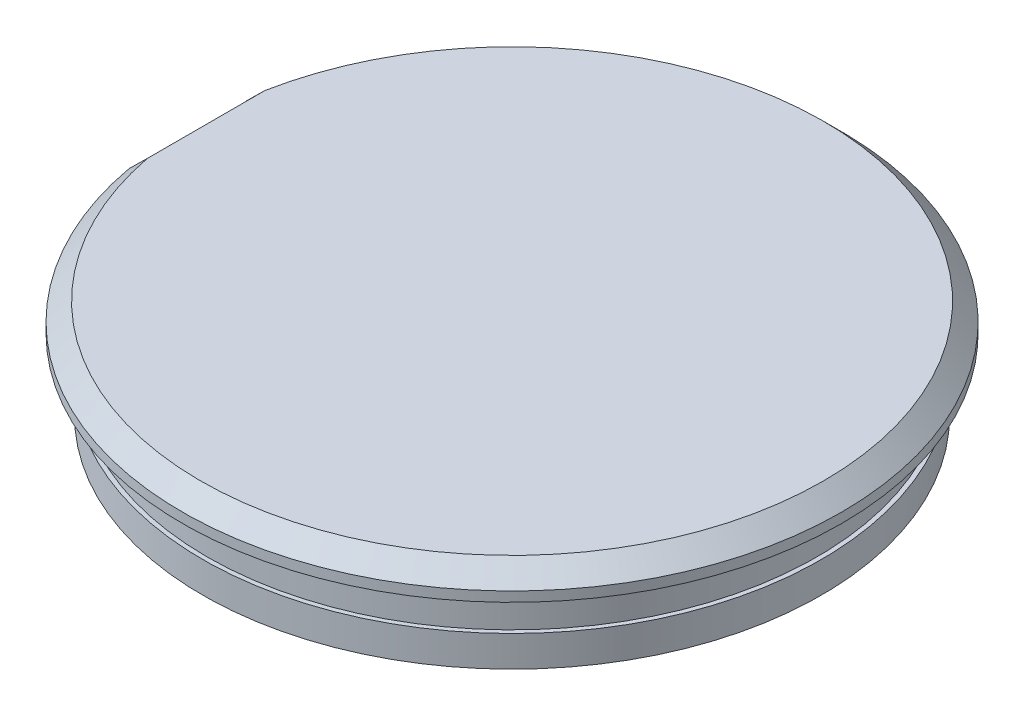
ISO-10303-21;
HEADER;
FILE_DESCRIPTION(('STEP AP214'),'2;1');
FILE_NAME('part.step','',(''),(''),'','','');
FILE_SCHEMA(('AUTOMOTIVE_DESIGN { 1 0 10303 214 1 1 1 1 }'));
ENDSEC;
DATA;
#1=APPLICATION_CONTEXT('core data for automotive mechanical design processes');
#2=APPLICATION_PROTOCOL_DEFINITION('international standard','automotive_design',2000,#1);
#3=PRODUCT_CONTEXT('',#1,'mechanical');
#4=PRODUCT('Part','Part','',(#3));
#5=PRODUCT_RELATED_PRODUCT_CATEGORY('part','',(#4));
#6=PRODUCT_DEFINITION_FORMATION('','',#4);
#7=PRODUCT_DEFINITION_CONTEXT('part definition',#1,'design');
#8=PRODUCT_DEFINITION('design','',#6,#7);
#9=PRODUCT_DEFINITION_SHAPE('','',#8);
#10=(LENGTH_UNIT() NAMED_UNIT(*) SI_UNIT(.MILLI.,.METRE.));
#11=(NAMED_UNIT(*) PLANE_ANGLE_UNIT() SI_UNIT($,.RADIAN.));
#12=(NAMED_UNIT(*) SI_UNIT($,.STERADIAN.) SOLID_ANGLE_UNIT());
#13=UNCERTAINTY_MEASURE_WITH_UNIT(LENGTH_MEASURE(1.E-05),#10,'distance_accuracy_value','');
#14=(GEOMETRIC_REPRESENTATION_CONTEXT(3) GLOBAL_UNCERTAINTY_ASSIGNED_CONTEXT((#13)) GLOBAL_UNIT_ASSIGNED_CONTEXT((#10,
#11,#12)) REPRESENTATION_CONTEXT('',''));
#15=CARTESIAN_POINT('',(0.,0.,0.));
#16=DIRECTION('',(0.,0.,1.));
#17=DIRECTION('',(1.,0.,0.));
#18=AXIS2_PLACEMENT_3D('',#15,#16,#17);
#19=CARTESIAN_POINT('',(0.,0.0919793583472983,0.));
#20=DIRECTION('',(0.,-1.,0.));
#21=DIRECTION('',(0.,0.,-1.));
#22=AXIS2_PLACEMENT_3D('',#19,#20,#21);
#23=PLANE('',#22);
#24=DIRECTION('',(0.,0.,1.));
#25=VECTOR('',#24,1.);
#26=CARTESIAN_POINT('',(-10.3835109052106,0.0919793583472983,0.));
#27=LINE('',#26,#25);
#28=CARTESIAN_POINT('',(-10.3835109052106,0.0919793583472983,-1.55971192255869));
#29=VERTEX_POINT('',#28);
#30=CARTESIAN_POINT('',(-10.3835109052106,0.0919793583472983,1.55971192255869));
#31=VERTEX_POINT('',#30);
#32=EDGE_CURVE('E175',#29,#31,#27,.T.);
#33=ORIENTED_EDGE('',*,*,#32,.F.);
#34=CARTESIAN_POINT('',(0.,0.0919793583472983,0.));
#35=DIRECTION('',(0.,-1.,0.));
#36=DIRECTION('',(0.,0.,-1.));
#37=AXIS2_PLACEMENT_3D('',#34,#35,#36);
#38=CIRCLE('',#37,10.5);
#39=EDGE_CURVE('E11',#29,#31,#38,.T.);
#40=ORIENTED_EDGE('',*,*,#39,.T.);
#41=EDGE_LOOP('',(#33,#40));
#42=FACE_BOUND('',#41,.T.);
#43=ADVANCED_FACE('F33',(#42),#23,.T.);
#44=CARTESIAN_POINT('',(0.,0.,0.));
#45=DIRECTION('',(0.,-1.,0.));
#46=DIRECTION('',(0.,0.,-1.));
#47=AXIS2_PLACEMENT_3D('',#44,#45,#46);
#48=CYLINDRICAL_SURFACE('',#47,10.5);
#49=DIRECTION('',(0.,-1.,0.));
#50=VECTOR('',#49,1.);
#51=CARTESIAN_POINT('',(-10.3835109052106,0.,1.55971192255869));
#52=LINE('',#51,#50);
#53=CARTESIAN_POINT('',(-10.3835109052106,1.1419793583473,1.55971192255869));
#54=VERTEX_POINT('',#53);
#55=EDGE_CURVE('E55',#31,#54,#52,.F.);
#56=ORIENTED_EDGE('',*,*,#55,.F.);
#57=ORIENTED_EDGE('',*,*,#39,.F.);
#58=DIRECTION('',(0.,-1.,0.));
#59=VECTOR('',#58,1.);
#60=CARTESIAN_POINT('',(-10.3835109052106,0.,-1.55971192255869));
#61=LINE('',#60,#59);
#62=CARTESIAN_POINT('',(-10.3835109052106,1.1419793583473,-1.55971192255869));
#63=VERTEX_POINT('',#62);
#64=EDGE_CURVE('E201',#63,#29,#61,.T.);
#65=ORIENTED_EDGE('',*,*,#64,.F.);
#66=CARTESIAN_POINT('',(0.,1.1419793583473,0.));
#67=DIRECTION('',(0.,-1.,0.));
#68=DIRECTION('',(0.,0.,-1.));
#69=AXIS2_PLACEMENT_3D('',#66,#67,#68);
#70=CIRCLE('',#69,10.5);
#71=EDGE_CURVE('E40',#63,#54,#70,.T.);
#72=ORIENTED_EDGE('',*,*,#71,.T.);
#73=EDGE_LOOP('',(#56,#57,#65,#72));
#74=FACE_BOUND('',#73,.T.);
#75=ADVANCED_FACE('F199',(#74),#48,.T.);
#76=CARTESIAN_POINT('',(10.5,1.1419793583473,0.));
#77=DIRECTION('',(0.,1.,0.));
#78=DIRECTION('',(0.,0.,1.));
#79=AXIS2_PLACEMENT_3D('',#76,#77,#78);
#80=PLANE('',#79);
#81=DIRECTION('',(0.,0.,-1.));
#82=VECTOR('',#81,1.);
#83=CARTESIAN_POINT('',(-10.3835109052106,1.1419793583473,0.));
#84=LINE('',#83,#82);
#85=EDGE_CURVE('E205',#54,#63,#84,.T.);
#86=ORIENTED_EDGE('',*,*,#85,.F.);
#87=ORIENTED_EDGE('',*,*,#71,.F.);
#88=EDGE_LOOP('',(#86,#87));
#89=FACE_BOUND('',#88,.T.);
#90=CARTESIAN_POINT('',(0.,1.1419793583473,0.));
#91=DIRECTION('',(0.,-1.,0.));
#92=DIRECTION('',(0.,0.,-1.));
#93=AXIS2_PLACEMENT_3D('',#90,#91,#92);
#94=CIRCLE('',#93,10.35);
#95=CARTESIAN_POINT('',(0.,1.1419793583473,-10.35));
#96=VERTEX_POINT('',#95);
#97=EDGE_CURVE('E193',#96,#96,#94,.T.);
#98=ORIENTED_EDGE('',*,*,#97,.T.);
#99=EDGE_LOOP('',(#98));
#100=FACE_BOUND('',#99,.T.);
#101=ADVANCED_FACE('F203',(#89,#100),#80,.T.);
#102=CARTESIAN_POINT('',(0.,0.,0.));
#103=DIRECTION('',(0.,-1.,0.));
#104=DIRECTION('',(0.,0.,-1.));
#105=AXIS2_PLACEMENT_3D('',#102,#103,#104);
#106=CYLINDRICAL_SURFACE('',#105,10.35);
#107=CARTESIAN_POINT('',(0.,2.5419793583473,0.));
#108=DIRECTION('',(0.,-1.,0.));
#109=DIRECTION('',(0.,0.,-1.));
#110=AXIS2_PLACEMENT_3D('',#107,#108,#109);
#111=CIRCLE('',#110,10.35);
#112=CARTESIAN_POINT('',(-10.1561455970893,2.5419793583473,1.99379201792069));
#113=VERTEX_POINT('',#112);
#114=CARTESIAN_POINT('',(-10.1561455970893,2.5419793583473,-1.99379201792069));
#115=VERTEX_POINT('',#114);
#116=EDGE_CURVE('E190',#113,#115,#111,.T.);
#117=ORIENTED_EDGE('',*,*,#116,.T.);
#118=EDGE_CURVE('E189',#115,#113,#111,.T.);
#119=ORIENTED_EDGE('',*,*,#118,.T.);
#120=EDGE_LOOP('',(#117,#119));
#121=FACE_BOUND('',#120,.T.);
#122=ORIENTED_EDGE('',*,*,#97,.F.);
#123=EDGE_LOOP('',(#122));
#124=FACE_BOUND('',#123,.T.);
#125=ADVANCED_FACE('F218',(#121,#124),#106,.T.);
#126=CARTESIAN_POINT('',(10.35,2.5419793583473,0.));
#127=DIRECTION('',(0.,-1.,0.));
#128=DIRECTION('',(0.,0.,-1.));
#129=AXIS2_PLACEMENT_3D('',#126,#127,#128);
#130=PLANE('',#129);
#131=DIRECTION('',(-1.,0.,0.));
#132=VECTOR('',#131,1.);
#133=CARTESIAN_POINT('',(10.35,2.5419793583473,1.99379201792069));
#134=LINE('',#133,#132);
#135=CARTESIAN_POINT('',(-11.0068365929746,2.5419793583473,1.99379201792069));
#136=VERTEX_POINT('',#135);
#137=EDGE_CURVE('E206',#113,#136,#134,.T.);
#138=ORIENTED_EDGE('',*,*,#137,.F.);
#139=ORIENTED_EDGE('',*,*,#118,.F.);
#140=DIRECTION('',(1.,0.,0.));
#141=VECTOR('',#140,1.);
#142=CARTESIAN_POINT('',(10.35,2.5419793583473,-1.99379201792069));
#143=LINE('',#142,#141);
#144=CARTESIAN_POINT('',(-11.0068365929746,2.5419793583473,-1.99379201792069));
#145=VERTEX_POINT('',#144);
#146=EDGE_CURVE('E178',#145,#115,#143,.T.);
#147=ORIENTED_EDGE('',*,*,#146,.F.);
#148=CARTESIAN_POINT('',(0.,2.5419793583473,0.));
#149=DIRECTION('',(0.,-1.,0.));
#150=DIRECTION('',(0.,0.,-1.));
#151=AXIS2_PLACEMENT_3D('',#148,#149,#150);
#152=CIRCLE('',#151,11.1859580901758);
#153=EDGE_CURVE('E186',#145,#136,#152,.T.);
#154=ORIENTED_EDGE('',*,*,#153,.T.);
#155=EDGE_LOOP('',(#138,#139,#147,#154));
#156=FACE_BOUND('',#155,.T.);
#157=ADVANCED_FACE('F223',(#156),#130,.T.);
#158=CARTESIAN_POINT('',(0.,0.,0.));
#159=DIRECTION('',(0.,-1.,0.));
#160=DIRECTION('',(0.,0.,-1.));
#161=AXIS2_PLACEMENT_3D('',#158,#159,#160);
#162=CYLINDRICAL_SURFACE('',#161,11.1859580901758);
#163=DIRECTION('',(0.,-1.,0.));
#164=VECTOR('',#163,1.);
#165=CARTESIAN_POINT('',(-11.0068365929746,0.,-1.99379201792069));
#166=LINE('',#165,#164);
#167=CARTESIAN_POINT('',(-11.0068365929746,2.87643509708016,-1.99379201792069));
#168=VERTEX_POINT('',#167);
#169=EDGE_CURVE('E174',#168,#145,#166,.T.);
#170=ORIENTED_EDGE('',*,*,#169,.F.);
#171=CARTESIAN_POINT('',(0.,2.87643509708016,0.));
#172=DIRECTION('',(0.,-1.,0.));
#173=DIRECTION('',(0.,0.,-1.));
#174=AXIS2_PLACEMENT_3D('',#171,#172,#173);
#175=CIRCLE('',#174,11.1859580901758);
#176=CARTESIAN_POINT('',(-11.0068365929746,2.87643509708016,1.99379201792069));
#177=VERTEX_POINT('',#176);
#178=EDGE_CURVE('E183',#168,#177,#175,.T.);
#179=ORIENTED_EDGE('',*,*,#178,.T.);
#180=DIRECTION('',(0.,-1.,0.));
#181=VECTOR('',#180,1.);
#182=CARTESIAN_POINT('',(-11.0068365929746,0.,1.99379201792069));
#183=LINE('',#182,#181);
#184=EDGE_CURVE('E149',#136,#177,#183,.F.);
#185=ORIENTED_EDGE('',*,*,#184,.F.);
#186=ORIENTED_EDGE('',*,*,#153,.F.);
#187=EDGE_LOOP('',(#170,#179,#185,#186));
#188=FACE_BOUND('',#187,.T.);
#189=ADVANCED_FACE('F226',(#188),#162,.T.);
#190=CARTESIAN_POINT('',(0.,2.87643509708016,0.));
#191=DIRECTION('',(0.,-1.,0.));
#192=DIRECTION('',(0.,0.,-1.));
#193=AXIS2_PLACEMENT_3D('',#190,#191,#192);
#194=CONICAL_SURFACE('',#193,11.1859580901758,0.785398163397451);
#195=CARTESIAN_POINT('',(-9.60490562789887,4.25273372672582,-1.99379201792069));
#196=CARTESIAN_POINT('',(-9.83275399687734,4.02963637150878,-1.99379201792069));
#197=CARTESIAN_POINT('',(-10.0604432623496,3.80637666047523,-1.99379201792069));
#198=CARTESIAN_POINT('',(-10.5155521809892,3.35958305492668,-1.99379201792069));
#199=CARTESIAN_POINT('',(-10.7429718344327,3.13604916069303,-1.99379201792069));
#200=CARTESIAN_POINT('',(-11.1975905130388,2.68875733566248,-1.99379201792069));
#201=CARTESIAN_POINT('',(-11.4247895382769,2.46499940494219,-1.99379201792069));
#202=CARTESIAN_POINT('',(-11.879001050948,2.01729382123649,-1.99379201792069));
#203=CARTESIAN_POINT('',(-12.1060135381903,1.79334616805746,-1.99379201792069));
#204=CARTESIAN_POINT('',(-12.3329495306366,1.56932107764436,-1.99379201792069));
#205=B_SPLINE_CURVE_WITH_KNOTS('',3,(#195,#196,#197,#198,#199,#200,#201,#202,#203,#204),
.UNSPECIFIED.,.F.,.F.,(4,2,2,2,4),(0.,0.956653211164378,1.91330544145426,2.86995734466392,
3.82661022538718),.UNSPECIFIED.);
#206=CARTESIAN_POINT('',(-10.3835109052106,3.48919568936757,-1.99379201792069));
#207=VERTEX_POINT('',#206);
#208=EDGE_CURVE('E168',#207,#168,#205,.T.);
#209=ORIENTED_EDGE('',*,*,#208,.F.);
#210=CARTESIAN_POINT('',(0.,3.48919568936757,0.));
#211=DIRECTION('',(0.,-1.,0.));
#212=DIRECTION('',(0.,0.,-1.));
#213=AXIS2_PLACEMENT_3D('',#210,#211,#212);
#214=CIRCLE('',#213,10.5731974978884);
#215=CARTESIAN_POINT('',(-10.3835109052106,3.48919568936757,1.99379201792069));
#216=VERTEX_POINT('',#215);
#217=EDGE_CURVE('E180',#207,#216,#214,.T.);
#218=ORIENTED_EDGE('',*,*,#217,.T.);
#219=CARTESIAN_POINT('',(-12.3329495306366,1.56932107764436,1.99379201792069));
#220=CARTESIAN_POINT('',(-12.1060135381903,1.79334616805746,1.99379201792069));
#221=CARTESIAN_POINT('',(-11.879001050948,2.0172938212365,1.99379201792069));
#222=CARTESIAN_POINT('',(-11.4247895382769,2.46499940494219,1.99379201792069));
#223=CARTESIAN_POINT('',(-11.1975905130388,2.68875733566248,1.99379201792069));
#224=CARTESIAN_POINT('',(-10.7429718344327,3.13604916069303,1.99379201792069));
#225=CARTESIAN_POINT('',(-10.5155521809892,3.35958305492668,1.99379201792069));
#226=CARTESIAN_POINT('',(-10.0604432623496,3.80637666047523,1.99379201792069));
#227=CARTESIAN_POINT('',(-9.83275399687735,4.02963637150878,1.99379201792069));
#228=CARTESIAN_POINT('',(-9.60490562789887,4.25273372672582,1.99379201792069));
#229=B_SPLINE_CURVE_WITH_KNOTS('',3,(#219,#220,#221,#222,#223,#224,#225,#226,#227,#228),
.UNSPECIFIED.,.F.,.F.,(4,2,2,2,4),(0.,0.956652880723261,1.91330478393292,2.8699570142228,
3.82661022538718),.UNSPECIFIED.);
#230=EDGE_CURVE('E141',#177,#216,#229,.T.);
#231=ORIENTED_EDGE('',*,*,#230,.F.);
#232=ORIENTED_EDGE('',*,*,#178,.F.);
#233=EDGE_LOOP('',(#209,#218,#231,#232));
#234=FACE_BOUND('',#233,.T.);
#235=ADVANCED_FACE('F151',(#234),#194,.T.);
#236=CARTESIAN_POINT('',(10.5731974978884,3.48919568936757,0.));
#237=DIRECTION('',(0.,1.,0.));
#238=DIRECTION('',(0.,0.,1.));
#239=AXIS2_PLACEMENT_3D('',#236,#237,#238);
#240=PLANE('',#239);
#241=DIRECTION('',(0.,0.,-1.));
#242=VECTOR('',#241,1.);
#243=CARTESIAN_POINT('',(-10.3835109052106,3.48919568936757,-1.99379201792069));
#244=LINE('',#243,#242);
#245=EDGE_CURVE('E132',#216,#207,#244,.T.);
#246=ORIENTED_EDGE('',*,*,#245,.F.);
#247=ORIENTED_EDGE('',*,*,#217,.F.);
#248=EDGE_LOOP('',(#246,#247));
#249=FACE_BOUND('',#248,.T.);
#250=ADVANCED_FACE('F166',(#249),#240,.T.);
#251=CARTESIAN_POINT('',(-10.3835109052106,-6.51080431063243,-1.99379201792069));
#252=DIRECTION('',(1.,0.,0.));
#253=DIRECTION('',(0.,0.,-1.));
#254=AXIS2_PLACEMENT_3D('',#251,#252,#253);
#255=PLANE('',#254);
#256=DIRECTION('',(0.,1.,0.));
#257=VECTOR('',#256,1.);
#258=CARTESIAN_POINT('',(-10.3835109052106,-6.51080431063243,-1.99379201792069));
#259=LINE('',#258,#257);
#260=CARTESIAN_POINT('',(-10.3835109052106,3.04356179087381,-1.99379201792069));
#261=VERTEX_POINT('',#260);
#262=EDGE_CURVE('E139',#261,#207,#259,.T.);
#263=ORIENTED_EDGE('',*,*,#262,.F.);
#264=DIRECTION('',(0.,0.,-1.));
#265=VECTOR('',#264,1.);
#266=CARTESIAN_POINT('',(-10.3835109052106,3.04356179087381,1.99379201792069));
#267=LINE('',#266,#265);
#268=CARTESIAN_POINT('',(-10.3835109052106,3.04356179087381,1.99379201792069));
#269=VERTEX_POINT('',#268);
#270=EDGE_CURVE('E47',#269,#261,#267,.T.);
#271=ORIENTED_EDGE('',*,*,#270,.F.);
#272=DIRECTION('',(0.,1.,0.));
#273=VECTOR('',#272,1.);
#274=CARTESIAN_POINT('',(-10.3835109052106,-6.51080431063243,1.99379201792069));
#275=LINE('',#274,#273);
#276=EDGE_CURVE('E111',#269,#216,#275,.T.);
#277=ORIENTED_EDGE('',*,*,#276,.T.);
#278=ORIENTED_EDGE('',*,*,#245,.T.);
#279=EDGE_LOOP('',(#263,#271,#277,#278));
#280=FACE_BOUND('',#279,.T.);
#281=ADVANCED_FACE('F160',(#280),#255,.F.);
#282=CARTESIAN_POINT('',(-11.9884052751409,-6.51080431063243,1.99379201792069));
#283=DIRECTION('',(0.,0.,1.));
#284=DIRECTION('',(1.,0.,0.));
#285=AXIS2_PLACEMENT_3D('',#282,#283,#284);
#286=PLANE('',#285);
#287=ORIENTED_EDGE('',*,*,#137,.T.);
#288=ORIENTED_EDGE('',*,*,#184,.T.);
#289=ORIENTED_EDGE('',*,*,#230,.T.);
#290=ORIENTED_EDGE('',*,*,#276,.F.);
#291=DIRECTION('',(-1.,0.,0.));
#292=VECTOR('',#291,1.);
#293=CARTESIAN_POINT('',(-9.38351090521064,3.04356179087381,1.99379201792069));
#294=LINE('',#293,#292);
#295=CARTESIAN_POINT('',(-9.38351090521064,3.04356179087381,1.99379201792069));
#296=VERTEX_POINT('',#295);
#297=EDGE_CURVE('E103',#296,#269,#294,.T.);
#298=ORIENTED_EDGE('',*,*,#297,.F.);
#299=DIRECTION('',(0.,1.,0.));
#300=VECTOR('',#299,1.);
#301=CARTESIAN_POINT('',(-9.38351090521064,2.5419793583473,1.99379201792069));
#302=LINE('',#301,#300);
#303=CARTESIAN_POINT('',(-9.38351090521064,2.5419793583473,1.99379201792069));
#304=VERTEX_POINT('',#303);
#305=EDGE_CURVE('E108',#304,#296,#302,.T.);
#306=ORIENTED_EDGE('',*,*,#305,.F.);
#307=DIRECTION('',(-1.,0.,0.));
#308=VECTOR('',#307,1.);
#309=CARTESIAN_POINT('',(-9.38351090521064,2.5419793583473,1.99379201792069));
#310=LINE('',#309,#308);
#311=EDGE_CURVE('E130',#304,#113,#310,.T.);
#312=ORIENTED_EDGE('',*,*,#311,.T.);
#313=EDGE_LOOP('',(#287,#288,#289,#290,#298,#306,#312));
#314=FACE_BOUND('',#313,.T.);
#315=ADVANCED_FACE('F105',(#314),#286,.F.);
#316=CARTESIAN_POINT('',(-11.9884052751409,-6.51080431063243,-1.99379201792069));
#317=DIRECTION('',(0.,0.,-1.));
#318=DIRECTION('',(-1.,0.,0.));
#319=AXIS2_PLACEMENT_3D('',#316,#317,#318);
#320=PLANE('',#319);
#321=ORIENTED_EDGE('',*,*,#146,.T.);
#322=DIRECTION('',(-1.,0.,0.));
#323=VECTOR('',#322,1.);
#324=CARTESIAN_POINT('',(-9.38351090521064,2.5419793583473,-1.99379201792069));
#325=LINE('',#324,#323);
#326=CARTESIAN_POINT('',(-9.38351090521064,2.5419793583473,-1.99379201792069));
#327=VERTEX_POINT('',#326);
#328=EDGE_CURVE('E133',#327,#115,#325,.T.);
#329=ORIENTED_EDGE('',*,*,#328,.F.);
#330=DIRECTION('',(0.,-1.,0.));
#331=VECTOR('',#330,1.);
#332=CARTESIAN_POINT('',(-9.38351090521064,2.5419793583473,-1.99379201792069));
#333=LINE('',#332,#331);
#334=CARTESIAN_POINT('',(-9.38351090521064,3.04356179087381,-1.99379201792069));
#335=VERTEX_POINT('',#334);
#336=EDGE_CURVE('E121',#335,#327,#333,.T.);
#337=ORIENTED_EDGE('',*,*,#336,.F.);
#338=DIRECTION('',(-1.,0.,0.));
#339=VECTOR('',#338,1.);
#340=CARTESIAN_POINT('',(-9.38351090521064,3.04356179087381,-1.99379201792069));
#341=LINE('',#340,#339);
#342=EDGE_CURVE('E112',#335,#261,#341,.T.);
#343=ORIENTED_EDGE('',*,*,#342,.T.);
#344=ORIENTED_EDGE('',*,*,#262,.T.);
#345=ORIENTED_EDGE('',*,*,#208,.T.);
#346=ORIENTED_EDGE('',*,*,#169,.T.);
#347=EDGE_LOOP('',(#321,#329,#337,#343,#344,#345,#346));
#348=FACE_BOUND('',#347,.T.);
#349=ADVANCED_FACE('F159',(#348),#320,.F.);
#350=ORIENTED_EDGE('',*,*,#32,.T.);
#351=ORIENTED_EDGE('',*,*,#55,.T.);
#352=ORIENTED_EDGE('',*,*,#85,.T.);
#353=ORIENTED_EDGE('',*,*,#64,.T.);
#354=EDGE_LOOP('',(#350,#351,#352,#353));
#355=FACE_BOUND('',#354,.T.);
#356=ADVANCED_FACE('F164',(#355),#255,.F.);
#357=CARTESIAN_POINT('',(-9.38351090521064,2.5419793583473,1.99379201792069));
#358=DIRECTION('',(0.,-1.,0.));
#359=DIRECTION('',(0.,0.,-1.));
#360=AXIS2_PLACEMENT_3D('',#357,#358,#359);
#361=PLANE('',#360);
#362=ORIENTED_EDGE('',*,*,#116,.F.);
#363=ORIENTED_EDGE('',*,*,#311,.F.);
#364=DIRECTION('',(0.,0.,1.));
#365=VECTOR('',#364,1.);
#366=CARTESIAN_POINT('',(-9.38351090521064,2.5419793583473,1.99379201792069));
#367=LINE('',#366,#365);
#368=EDGE_CURVE('E113',#327,#304,#367,.T.);
#369=ORIENTED_EDGE('',*,*,#368,.F.);
#370=ORIENTED_EDGE('',*,*,#328,.T.);
#371=EDGE_LOOP('',(#362,#363,#369,#370));
#372=FACE_BOUND('',#371,.T.);
#373=ADVANCED_FACE('F248',(#372),#361,.F.);
#374=CARTESIAN_POINT('',(-9.38351090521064,3.04356179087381,1.99379201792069));
#375=DIRECTION('',(0.,1.,0.));
#376=DIRECTION('',(0.,0.,1.));
#377=AXIS2_PLACEMENT_3D('',#374,#375,#376);
#378=PLANE('',#377);
#379=ORIENTED_EDGE('',*,*,#270,.T.);
#380=ORIENTED_EDGE('',*,*,#342,.F.);
#381=DIRECTION('',(0.,0.,-1.));
#382=VECTOR('',#381,1.);
#383=CARTESIAN_POINT('',(-9.38351090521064,3.04356179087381,1.99379201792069));
#384=LINE('',#383,#382);
#385=EDGE_CURVE('E116',#296,#335,#384,.T.);
#386=ORIENTED_EDGE('',*,*,#385,.F.);
#387=ORIENTED_EDGE('',*,*,#297,.T.);
#388=EDGE_LOOP('',(#379,#380,#386,#387));
#389=FACE_BOUND('',#388,.T.);
#390=ADVANCED_FACE('F117',(#389),#378,.F.);
#391=CARTESIAN_POINT('',(-9.38351090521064,0.,0.));
#392=DIRECTION('',(-1.,0.,0.));
#393=DIRECTION('',(0.,0.,1.));
#394=AXIS2_PLACEMENT_3D('',#391,#392,#393);
#395=PLANE('',#394);
#396=ORIENTED_EDGE('',*,*,#305,.T.);
#397=ORIENTED_EDGE('',*,*,#385,.T.);
#398=ORIENTED_EDGE('',*,*,#336,.T.);
#399=ORIENTED_EDGE('',*,*,#368,.T.);
#400=EDGE_LOOP('',(#396,#397,#398,#399));
#401=FACE_BOUND('',#400,.T.);
#402=ADVANCED_FACE('F123',(#401),#395,.T.);
#403=CLOSED_SHELL('',(#43,#75,#101,#125,#157,#189,#235,#250,#281,#315,#349,#356,#373,#390,#402));
#404=MANIFOLD_SOLID_BREP('B2',#403);
#405=ADVANCED_BREP_SHAPE_REPRESENTATION('',(#18,#404),#14);
#406=SHAPE_DEFINITION_REPRESENTATION(#9,#405);
ENDSEC;
END-ISO-10303-21;
